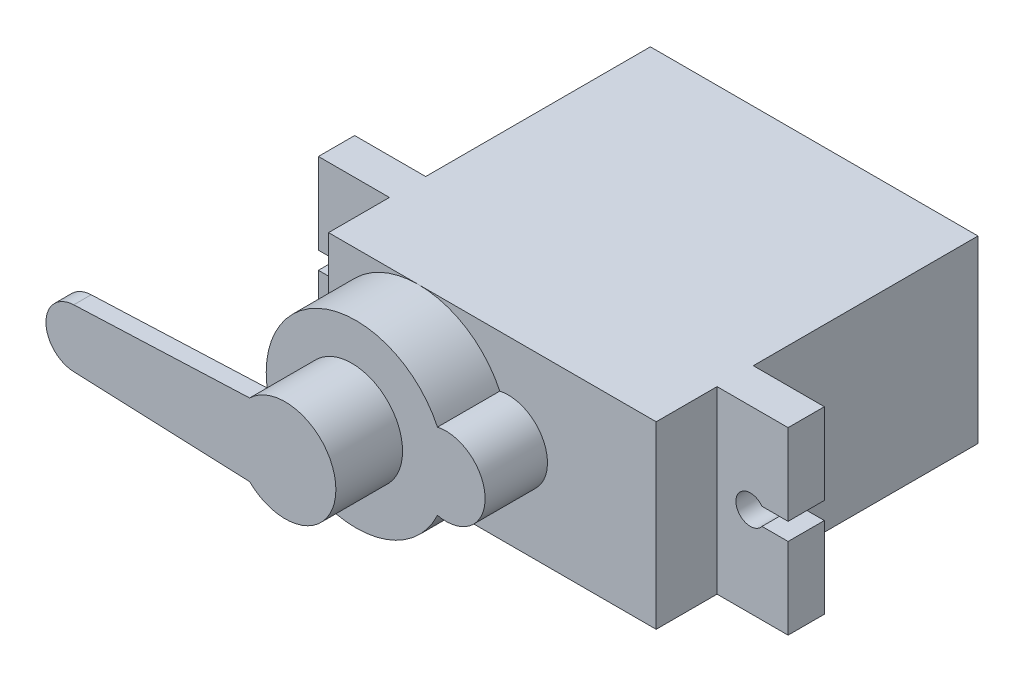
ISO-10303-21;
HEADER;
FILE_DESCRIPTION(('STEP AP214'),'2;1');
FILE_NAME('part.step','',(''),(''),'','','');
FILE_SCHEMA(('AUTOMOTIVE_DESIGN { 1 0 10303 214 1 1 1 1 }'));
ENDSEC;
DATA;
#1=APPLICATION_CONTEXT('core data for automotive mechanical design processes');
#2=APPLICATION_PROTOCOL_DEFINITION('international standard','automotive_design',2000,#1);
#3=PRODUCT_CONTEXT('',#1,'mechanical');
#4=PRODUCT('Part','Part','',(#3));
#5=PRODUCT_RELATED_PRODUCT_CATEGORY('part','',(#4));
#6=PRODUCT_DEFINITION_FORMATION('','',#4);
#7=PRODUCT_DEFINITION_CONTEXT('part definition',#1,'design');
#8=PRODUCT_DEFINITION('design','',#6,#7);
#9=PRODUCT_DEFINITION_SHAPE('','',#8);
#10=(LENGTH_UNIT() NAMED_UNIT(*) SI_UNIT(.MILLI.,.METRE.));
#11=(NAMED_UNIT(*) PLANE_ANGLE_UNIT() SI_UNIT($,.RADIAN.));
#12=(NAMED_UNIT(*) SI_UNIT($,.STERADIAN.) SOLID_ANGLE_UNIT());
#13=UNCERTAINTY_MEASURE_WITH_UNIT(LENGTH_MEASURE(1.E-05),#10,'distance_accuracy_value','');
#14=(GEOMETRIC_REPRESENTATION_CONTEXT(3) GLOBAL_UNCERTAINTY_ASSIGNED_CONTEXT((#13)) GLOBAL_UNIT_ASSIGNED_CONTEXT((#10,
#11,#12)) REPRESENTATION_CONTEXT('',''));
#15=CARTESIAN_POINT('',(0.,0.,0.));
#16=DIRECTION('',(0.,0.,1.));
#17=DIRECTION('',(1.,0.,0.));
#18=AXIS2_PLACEMENT_3D('',#15,#16,#17);
#19=CARTESIAN_POINT('',(-11.3,6.2,22.2));
#20=DIRECTION('',(1.,0.,0.));
#21=DIRECTION('',(0.,0.,-1.));
#22=AXIS2_PLACEMENT_3D('',#19,#20,#21);
#23=PLANE('',#22);
#24=DIRECTION('',(0.,1.,0.));
#25=VECTOR('',#24,1.);
#26=CARTESIAN_POINT('',(-11.3,-6.2,15.5));
#27=LINE('',#26,#25);
#28=CARTESIAN_POINT('',(-11.3,-6.2,15.5));
#29=VERTEX_POINT('',#28);
#30=CARTESIAN_POINT('',(-11.3,6.2,15.5));
#31=VERTEX_POINT('',#30);
#32=EDGE_CURVE('E378',#29,#31,#27,.T.);
#33=ORIENTED_EDGE('',*,*,#32,.T.);
#34=DIRECTION('',(0.,0.,-1.));
#35=VECTOR('',#34,1.);
#36=CARTESIAN_POINT('',(-11.3,6.2,22.2));
#37=LINE('',#36,#35);
#38=CARTESIAN_POINT('',(-11.3,6.2,0.));
#39=VERTEX_POINT('',#38);
#40=EDGE_CURVE('E530',#31,#39,#37,.T.);
#41=ORIENTED_EDGE('',*,*,#40,.T.);
#42=DIRECTION('',(0.,-1.,0.));
#43=VECTOR('',#42,1.);
#44=CARTESIAN_POINT('',(-11.3,6.2,0.));
#45=LINE('',#44,#43);
#46=CARTESIAN_POINT('',(-11.3,-6.2,0.));
#47=VERTEX_POINT('',#46);
#48=EDGE_CURVE('E506',#39,#47,#45,.T.);
#49=ORIENTED_EDGE('',*,*,#48,.T.);
#50=DIRECTION('',(0.,0.,-1.));
#51=VECTOR('',#50,1.);
#52=CARTESIAN_POINT('',(-11.3,-6.2,22.2));
#53=LINE('',#52,#51);
#54=EDGE_CURVE('E559',#29,#47,#53,.T.);
#55=ORIENTED_EDGE('',*,*,#54,.F.);
#56=EDGE_LOOP('',(#33,#41,#49,#55));
#57=FACE_BOUND('',#56,.T.);
#58=DIRECTION('',(0.,-1.,0.));
#59=VECTOR('',#58,1.);
#60=CARTESIAN_POINT('',(-11.3,1.75,4.));
#61=LINE('',#60,#59);
#62=CARTESIAN_POINT('',(-11.3,1.75,4.));
#63=VERTEX_POINT('',#62);
#64=CARTESIAN_POINT('',(-11.3,-1.75,4.));
#65=VERTEX_POINT('',#64);
#66=EDGE_CURVE('E278',#63,#65,#61,.T.);
#67=ORIENTED_EDGE('',*,*,#66,.F.);
#68=DIRECTION('',(0.,0.,-1.));
#69=VECTOR('',#68,1.);
#70=CARTESIAN_POINT('',(-11.3,1.75,4.));
#71=LINE('',#70,#69);
#72=CARTESIAN_POINT('',(-11.3,1.75,5.5));
#73=VERTEX_POINT('',#72);
#74=EDGE_CURVE('E275',#73,#63,#71,.T.);
#75=ORIENTED_EDGE('',*,*,#74,.F.);
#76=DIRECTION('',(0.,1.,0.));
#77=VECTOR('',#76,1.);
#78=CARTESIAN_POINT('',(-11.3,1.75,5.5));
#79=LINE('',#78,#77);
#80=CARTESIAN_POINT('',(-11.3,-1.75,5.5));
#81=VERTEX_POINT('',#80);
#82=EDGE_CURVE('E70',#81,#73,#79,.T.);
#83=ORIENTED_EDGE('',*,*,#82,.F.);
#84=DIRECTION('',(0.,0.,1.));
#85=VECTOR('',#84,1.);
#86=CARTESIAN_POINT('',(-11.3,-1.75,4.));
#87=LINE('',#86,#85);
#88=EDGE_CURVE('E65',#65,#81,#87,.T.);
#89=ORIENTED_EDGE('',*,*,#88,.F.);
#90=EDGE_LOOP('',(#67,#75,#83,#89));
#91=FACE_BOUND('',#90,.T.);
#92=ADVANCED_FACE('F49',(#57,#91),#23,.F.);
#93=CARTESIAN_POINT('',(13.2,-0.6,18.));
#94=DIRECTION('',(0.,1.,0.));
#95=DIRECTION('',(-1.,0.,0.));
#96=AXIS2_PLACEMENT_3D('',#93,#94,#95);
#97=PLANE('',#96);
#98=DIRECTION('',(1.,0.,0.));
#99=VECTOR('',#98,1.);
#100=CARTESIAN_POINT('',(13.2,-0.6,15.5));
#101=LINE('',#100,#99);
#102=CARTESIAN_POINT('',(14.4,-0.6,15.5));
#103=VERTEX_POINT('',#102);
#104=CARTESIAN_POINT('',(16.2,-0.6,15.5));
#105=VERTEX_POINT('',#104);
#106=EDGE_CURVE('E341',#103,#105,#101,.T.);
#107=ORIENTED_EDGE('',*,*,#106,.F.);
#108=DIRECTION('',(0.,0.,1.));
#109=VECTOR('',#108,1.);
#110=CARTESIAN_POINT('',(14.4,-0.6,12.6715728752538));
#111=LINE('',#110,#109);
#112=CARTESIAN_POINT('',(14.4,-0.6,18.));
#113=VERTEX_POINT('',#112);
#114=EDGE_CURVE('E298',#103,#113,#111,.T.);
#115=ORIENTED_EDGE('',*,*,#114,.T.);
#116=DIRECTION('',(1.,0.,0.));
#117=VECTOR('',#116,1.);
#118=CARTESIAN_POINT('',(13.2,-0.6,18.));
#119=LINE('',#118,#117);
#120=CARTESIAN_POINT('',(16.2,-0.6,18.));
#121=VERTEX_POINT('',#120);
#122=EDGE_CURVE('E316',#113,#121,#119,.T.);
#123=ORIENTED_EDGE('',*,*,#122,.T.);
#124=DIRECTION('',(0.,0.,-1.));
#125=VECTOR('',#124,1.);
#126=CARTESIAN_POINT('',(16.2,-0.6,18.));
#127=LINE('',#126,#125);
#128=EDGE_CURVE('E360',#121,#105,#127,.T.);
#129=ORIENTED_EDGE('',*,*,#128,.T.);
#130=EDGE_LOOP('',(#107,#115,#123,#129));
#131=FACE_BOUND('',#130,.T.);
#132=ADVANCED_FACE('F596',(#131),#97,.T.);
#133=CARTESIAN_POINT('',(16.2,0.6,18.));
#134=DIRECTION('',(0.,-1.,0.));
#135=DIRECTION('',(1.,0.,0.));
#136=AXIS2_PLACEMENT_3D('',#133,#134,#135);
#137=PLANE('',#136);
#138=DIRECTION('',(-1.,0.,0.));
#139=VECTOR('',#138,1.);
#140=CARTESIAN_POINT('',(16.2,0.6,18.));
#141=LINE('',#140,#139);
#142=CARTESIAN_POINT('',(16.2,0.6,18.));
#143=VERTEX_POINT('',#142);
#144=CARTESIAN_POINT('',(14.4,0.6,18.));
#145=VERTEX_POINT('',#144);
#146=EDGE_CURVE('E319',#143,#145,#141,.T.);
#147=ORIENTED_EDGE('',*,*,#146,.T.);
#148=DIRECTION('',(0.,0.,1.));
#149=VECTOR('',#148,1.);
#150=CARTESIAN_POINT('',(14.4,0.6,12.6715728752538));
#151=LINE('',#150,#149);
#152=CARTESIAN_POINT('',(14.4,0.6,15.5));
#153=VERTEX_POINT('',#152);
#154=EDGE_CURVE('E294',#145,#153,#151,.F.);
#155=ORIENTED_EDGE('',*,*,#154,.T.);
#156=DIRECTION('',(-1.,0.,0.));
#157=VECTOR('',#156,1.);
#158=CARTESIAN_POINT('',(16.2,0.6,15.5));
#159=LINE('',#158,#157);
#160=CARTESIAN_POINT('',(16.2,0.6,15.5));
#161=VERTEX_POINT('',#160);
#162=EDGE_CURVE('E344',#161,#153,#159,.T.);
#163=ORIENTED_EDGE('',*,*,#162,.F.);
#164=DIRECTION('',(0.,0.,-1.));
#165=VECTOR('',#164,1.);
#166=CARTESIAN_POINT('',(16.2,0.6,18.));
#167=LINE('',#166,#165);
#168=EDGE_CURVE('E357',#143,#161,#167,.T.);
#169=ORIENTED_EDGE('',*,*,#168,.F.);
#170=EDGE_LOOP('',(#147,#155,#163,#169));
#171=FACE_BOUND('',#170,.T.);
#172=ADVANCED_FACE('F603',(#171),#137,.T.);
#173=CARTESIAN_POINT('',(11.3,6.2,22.2));
#174=DIRECTION('',(-1.,0.,0.));
#175=DIRECTION('',(0.,0.,1.));
#176=AXIS2_PLACEMENT_3D('',#173,#174,#175);
#177=PLANE('',#176);
#178=DIRECTION('',(0.,1.,0.));
#179=VECTOR('',#178,1.);
#180=CARTESIAN_POINT('',(11.3,-6.2,15.5));
#181=LINE('',#180,#179);
#182=CARTESIAN_POINT('',(11.3,-6.2,15.5));
#183=VERTEX_POINT('',#182);
#184=CARTESIAN_POINT('',(11.3,6.2,15.5));
#185=VERTEX_POINT('',#184);
#186=EDGE_CURVE('E302',#183,#185,#181,.T.);
#187=ORIENTED_EDGE('',*,*,#186,.F.);
#188=DIRECTION('',(0.,0.,-1.));
#189=VECTOR('',#188,1.);
#190=CARTESIAN_POINT('',(11.3,-6.2,22.2));
#191=LINE('',#190,#189);
#192=CARTESIAN_POINT('',(11.3,-6.2,0.));
#193=VERTEX_POINT('',#192);
#194=EDGE_CURVE('E554',#183,#193,#191,.T.);
#195=ORIENTED_EDGE('',*,*,#194,.T.);
#196=DIRECTION('',(0.,1.,0.));
#197=VECTOR('',#196,1.);
#198=CARTESIAN_POINT('',(11.3,6.2,0.));
#199=LINE('',#198,#197);
#200=CARTESIAN_POINT('',(11.3,6.2,0.));
#201=VERTEX_POINT('',#200);
#202=EDGE_CURVE('E538',#193,#201,#199,.T.);
#203=ORIENTED_EDGE('',*,*,#202,.T.);
#204=DIRECTION('',(0.,0.,-1.));
#205=VECTOR('',#204,1.);
#206=CARTESIAN_POINT('',(11.3,6.2,22.2));
#207=LINE('',#206,#205);
#208=EDGE_CURVE('E549',#185,#201,#207,.T.);
#209=ORIENTED_EDGE('',*,*,#208,.F.);
#210=EDGE_LOOP('',(#187,#195,#203,#209));
#211=FACE_BOUND('',#210,.T.);
#212=ADVANCED_FACE('F679',(#211),#177,.F.);
#213=CARTESIAN_POINT('',(-5.1,0.,26.5));
#214=DIRECTION('',(0.,0.,-1.));
#215=DIRECTION('',(-1.,0.,0.));
#216=AXIS2_PLACEMENT_3D('',#213,#214,#215);
#217=CYLINDRICAL_SURFACE('',#216,6.2);
#218=DIRECTION('',(0.,0.,-1.));
#219=VECTOR('',#218,1.);
#220=CARTESIAN_POINT('',(0.512096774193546,-2.63521722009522,24.35));
#221=LINE('',#220,#219);
#222=CARTESIAN_POINT('',(0.512096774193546,-2.63521722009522,26.5));
#223=VERTEX_POINT('',#222);
#224=CARTESIAN_POINT('',(0.512096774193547,-2.63521722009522,22.2));
#225=VERTEX_POINT('',#224);
#226=EDGE_CURVE('E498',#223,#225,#221,.T.);
#227=ORIENTED_EDGE('',*,*,#226,.F.);
#228=CARTESIAN_POINT('',(-5.1,0.,26.5));
#229=DIRECTION('',(0.,0.,1.));
#230=DIRECTION('',(1.,0.,0.));
#231=AXIS2_PLACEMENT_3D('',#228,#229,#230);
#232=CIRCLE('',#231,6.2);
#233=CARTESIAN_POINT('',(0.512096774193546,2.63521722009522,26.5));
#234=VERTEX_POINT('',#233);
#235=EDGE_CURVE('E502',#234,#223,#232,.T.);
#236=ORIENTED_EDGE('',*,*,#235,.F.);
#237=DIRECTION('',(0.,0.,-1.));
#238=VECTOR('',#237,1.);
#239=CARTESIAN_POINT('',(0.512096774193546,2.63521722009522,24.35));
#240=LINE('',#239,#238);
#241=CARTESIAN_POINT('',(0.512096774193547,2.63521722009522,22.2));
#242=VERTEX_POINT('',#241);
#243=EDGE_CURVE('E494',#242,#234,#240,.F.);
#244=ORIENTED_EDGE('',*,*,#243,.F.);
#245=CARTESIAN_POINT('',(-5.1,0.,22.2));
#246=DIRECTION('',(0.,0.,1.));
#247=DIRECTION('',(1.,0.,0.));
#248=AXIS2_PLACEMENT_3D('',#245,#246,#247);
#249=CIRCLE('',#248,6.2);
#250=CARTESIAN_POINT('',(-5.1,6.2,22.2));
#251=VERTEX_POINT('',#250);
#252=EDGE_CURVE('E510',#242,#251,#249,.T.);
#253=ORIENTED_EDGE('',*,*,#252,.T.);
#254=CARTESIAN_POINT('',(-11.3,0.,22.2));
#255=VERTEX_POINT('',#254);
#256=EDGE_CURVE('E501',#251,#255,#249,.T.);
#257=ORIENTED_EDGE('',*,*,#256,.T.);
#258=CARTESIAN_POINT('',(-5.1,-6.2,22.2));
#259=VERTEX_POINT('',#258);
#260=EDGE_CURVE('E488',#255,#259,#249,.T.);
#261=ORIENTED_EDGE('',*,*,#260,.T.);
#262=EDGE_CURVE('E511',#259,#225,#249,.T.);
#263=ORIENTED_EDGE('',*,*,#262,.T.);
#264=EDGE_LOOP('',(#227,#236,#244,#253,#257,#261,#263));
#265=FACE_BOUND('',#264,.T.);
#266=ADVANCED_FACE('F647',(#265),#217,.T.);
#267=CARTESIAN_POINT('',(0.,0.,22.2));
#268=DIRECTION('',(0.,0.,1.));
#269=DIRECTION('',(1.,0.,0.));
#270=AXIS2_PLACEMENT_3D('',#267,#268,#269);
#271=PLANE('',#270);
#272=ORIENTED_EDGE('',*,*,#256,.F.);
#273=DIRECTION('',(-1.,0.,0.));
#274=VECTOR('',#273,1.);
#275=CARTESIAN_POINT('',(-11.3,6.2,22.2));
#276=LINE('',#275,#274);
#277=CARTESIAN_POINT('',(-11.3,6.2,22.2));
#278=VERTEX_POINT('',#277);
#279=EDGE_CURVE('E525',#251,#278,#276,.T.);
#280=ORIENTED_EDGE('',*,*,#279,.T.);
#281=DIRECTION('',(0.,-1.,0.));
#282=VECTOR('',#281,1.);
#283=CARTESIAN_POINT('',(-11.3,6.2,22.2));
#284=LINE('',#283,#282);
#285=EDGE_CURVE('E512',#278,#255,#284,.T.);
#286=ORIENTED_EDGE('',*,*,#285,.T.);
#287=EDGE_LOOP('',(#272,#280,#286));
#288=FACE_BOUND('',#287,.T.);
#289=ADVANCED_FACE('F618',(#288),#271,.T.);
#290=ORIENTED_EDGE('',*,*,#260,.F.);
#291=CARTESIAN_POINT('',(-11.3,-6.2,22.2));
#292=VERTEX_POINT('',#291);
#293=EDGE_CURVE('E517',#255,#292,#284,.T.);
#294=ORIENTED_EDGE('',*,*,#293,.T.);
#295=DIRECTION('',(1.,0.,0.));
#296=VECTOR('',#295,1.);
#297=CARTESIAN_POINT('',(-11.3,-6.2,22.2));
#298=LINE('',#297,#296);
#299=EDGE_CURVE('E518',#292,#259,#298,.T.);
#300=ORIENTED_EDGE('',*,*,#299,.T.);
#301=EDGE_LOOP('',(#290,#294,#300));
#302=FACE_BOUND('',#301,.T.);
#303=ADVANCED_FACE('F608',(#302),#271,.T.);
#304=CARTESIAN_POINT('',(-11.3,6.2,18.));
#305=VERTEX_POINT('',#304);
#306=EDGE_CURVE('E546',#278,#305,#37,.T.);
#307=ORIENTED_EDGE('',*,*,#306,.T.);
#308=DIRECTION('',(0.,1.,0.));
#309=VECTOR('',#308,1.);
#310=CARTESIAN_POINT('',(-11.3,-6.2,18.));
#311=LINE('',#310,#309);
#312=CARTESIAN_POINT('',(-11.3,-6.2,18.));
#313=VERTEX_POINT('',#312);
#314=EDGE_CURVE('E379',#313,#305,#311,.T.);
#315=ORIENTED_EDGE('',*,*,#314,.F.);
#316=EDGE_CURVE('E560',#292,#313,#53,.T.);
#317=ORIENTED_EDGE('',*,*,#316,.F.);
#318=ORIENTED_EDGE('',*,*,#293,.F.);
#319=ORIENTED_EDGE('',*,*,#285,.F.);
#320=EDGE_LOOP('',(#307,#315,#317,#318,#319));
#321=FACE_BOUND('',#320,.T.);
#322=ADVANCED_FACE('F51',(#321),#23,.F.);
#323=CARTESIAN_POINT('',(-11.3,-6.2,22.2));
#324=DIRECTION('',(0.,1.,0.));
#325=DIRECTION('',(-1.,0.,0.));
#326=AXIS2_PLACEMENT_3D('',#323,#324,#325);
#327=PLANE('',#326);
#328=DIRECTION('',(1.,0.,0.));
#329=VECTOR('',#328,1.);
#330=CARTESIAN_POINT('',(-11.3,-6.2,0.));
#331=LINE('',#330,#329);
#332=EDGE_CURVE('E534',#47,#193,#331,.T.);
#333=ORIENTED_EDGE('',*,*,#332,.T.);
#334=ORIENTED_EDGE('',*,*,#194,.F.);
#335=DIRECTION('',(-1.,0.,0.));
#336=VECTOR('',#335,1.);
#337=CARTESIAN_POINT('',(16.2,-6.2,15.5));
#338=LINE('',#337,#336);
#339=CARTESIAN_POINT('',(16.2,-6.2,15.5));
#340=VERTEX_POINT('',#339);
#341=EDGE_CURVE('E334',#340,#183,#338,.T.);
#342=ORIENTED_EDGE('',*,*,#341,.F.);
#343=DIRECTION('',(0.,0.,-1.));
#344=VECTOR('',#343,1.);
#345=CARTESIAN_POINT('',(16.2,-6.2,18.));
#346=LINE('',#345,#344);
#347=CARTESIAN_POINT('',(16.2,-6.2,18.));
#348=VERTEX_POINT('',#347);
#349=EDGE_CURVE('E364',#348,#340,#346,.T.);
#350=ORIENTED_EDGE('',*,*,#349,.F.);
#351=DIRECTION('',(-1.,0.,0.));
#352=VECTOR('',#351,1.);
#353=CARTESIAN_POINT('',(16.2,-6.2,18.));
#354=LINE('',#353,#352);
#355=CARTESIAN_POINT('',(11.3,-6.2,18.));
#356=VERTEX_POINT('',#355);
#357=EDGE_CURVE('E307',#348,#356,#354,.T.);
#358=ORIENTED_EDGE('',*,*,#357,.T.);
#359=CARTESIAN_POINT('',(11.3,-6.2,22.2));
#360=VERTEX_POINT('',#359);
#361=EDGE_CURVE('E555',#360,#356,#191,.T.);
#362=ORIENTED_EDGE('',*,*,#361,.F.);
#363=EDGE_CURVE('E516',#259,#360,#298,.T.);
#364=ORIENTED_EDGE('',*,*,#363,.F.);
#365=ORIENTED_EDGE('',*,*,#299,.F.);
#366=ORIENTED_EDGE('',*,*,#316,.T.);
#367=DIRECTION('',(1.,0.,0.));
#368=VECTOR('',#367,1.);
#369=CARTESIAN_POINT('',(-16.2,-6.2,18.));
#370=LINE('',#369,#368);
#371=CARTESIAN_POINT('',(-16.2,-6.2,18.));
#372=VERTEX_POINT('',#371);
#373=EDGE_CURVE('E400',#372,#313,#370,.T.);
#374=ORIENTED_EDGE('',*,*,#373,.F.);
#375=DIRECTION('',(0.,0.,-1.));
#376=VECTOR('',#375,1.);
#377=CARTESIAN_POINT('',(-16.2,-6.2,18.));
#378=LINE('',#377,#376);
#379=CARTESIAN_POINT('',(-16.2,-6.2,15.5));
#380=VERTEX_POINT('',#379);
#381=EDGE_CURVE('E404',#372,#380,#378,.T.);
#382=ORIENTED_EDGE('',*,*,#381,.T.);
#383=DIRECTION('',(1.,0.,0.));
#384=VECTOR('',#383,1.);
#385=CARTESIAN_POINT('',(-16.2,-6.2,15.5));
#386=LINE('',#385,#384);
#387=EDGE_CURVE('E384',#380,#29,#386,.T.);
#388=ORIENTED_EDGE('',*,*,#387,.T.);
#389=ORIENTED_EDGE('',*,*,#54,.T.);
#390=EDGE_LOOP('',(#333,#334,#342,#350,#358,#362,#364,#365,#366,#374,#382,#388,#389));
#391=FACE_BOUND('',#390,.T.);
#392=ADVANCED_FACE('F607',(#391),#327,.F.);
#393=ORIENTED_EDGE('',*,*,#361,.T.);
#394=DIRECTION('',(0.,1.,0.));
#395=VECTOR('',#394,1.);
#396=CARTESIAN_POINT('',(11.3,-6.2,18.));
#397=LINE('',#396,#395);
#398=CARTESIAN_POINT('',(11.3,6.2,18.));
#399=VERTEX_POINT('',#398);
#400=EDGE_CURVE('E303',#356,#399,#397,.T.);
#401=ORIENTED_EDGE('',*,*,#400,.T.);
#402=CARTESIAN_POINT('',(11.3,6.2,22.2));
#403=VERTEX_POINT('',#402);
#404=EDGE_CURVE('E550',#403,#399,#207,.T.);
#405=ORIENTED_EDGE('',*,*,#404,.F.);
#406=DIRECTION('',(0.,1.,0.));
#407=VECTOR('',#406,1.);
#408=CARTESIAN_POINT('',(11.3,6.2,22.2));
#409=LINE('',#408,#407);
#410=EDGE_CURVE('E522',#360,#403,#409,.T.);
#411=ORIENTED_EDGE('',*,*,#410,.F.);
#412=EDGE_LOOP('',(#393,#401,#405,#411));
#413=FACE_BOUND('',#412,.T.);
#414=ADVANCED_FACE('F615',(#413),#177,.F.);
#415=CARTESIAN_POINT('',(-11.3,6.2,22.2));
#416=DIRECTION('',(0.,-1.,0.));
#417=DIRECTION('',(1.,0.,0.));
#418=AXIS2_PLACEMENT_3D('',#415,#416,#417);
#419=PLANE('',#418);
#420=DIRECTION('',(-1.,0.,0.));
#421=VECTOR('',#420,1.);
#422=CARTESIAN_POINT('',(-11.3,6.2,0.));
#423=LINE('',#422,#421);
#424=EDGE_CURVE('E542',#201,#39,#423,.T.);
#425=ORIENTED_EDGE('',*,*,#424,.T.);
#426=ORIENTED_EDGE('',*,*,#40,.F.);
#427=DIRECTION('',(-1.,0.,0.));
#428=VECTOR('',#427,1.);
#429=CARTESIAN_POINT('',(-11.3,6.2,15.5));
#430=LINE('',#429,#428);
#431=CARTESIAN_POINT('',(-16.2,6.2,15.5));
#432=VERTEX_POINT('',#431);
#433=EDGE_CURVE('E408',#31,#432,#430,.T.);
#434=ORIENTED_EDGE('',*,*,#433,.T.);
#435=DIRECTION('',(0.,0.,-1.));
#436=VECTOR('',#435,1.);
#437=CARTESIAN_POINT('',(-16.2,6.2,18.));
#438=LINE('',#437,#436);
#439=CARTESIAN_POINT('',(-16.2,6.2,18.));
#440=VERTEX_POINT('',#439);
#441=EDGE_CURVE('E438',#440,#432,#438,.T.);
#442=ORIENTED_EDGE('',*,*,#441,.F.);
#443=DIRECTION('',(-1.,0.,0.));
#444=VECTOR('',#443,1.);
#445=CARTESIAN_POINT('',(-11.3,6.2,18.));
#446=LINE('',#445,#444);
#447=EDGE_CURVE('E383',#305,#440,#446,.T.);
#448=ORIENTED_EDGE('',*,*,#447,.F.);
#449=ORIENTED_EDGE('',*,*,#306,.F.);
#450=ORIENTED_EDGE('',*,*,#279,.F.);
#451=EDGE_CURVE('E526',#403,#251,#276,.T.);
#452=ORIENTED_EDGE('',*,*,#451,.F.);
#453=ORIENTED_EDGE('',*,*,#404,.T.);
#454=DIRECTION('',(1.,0.,0.));
#455=VECTOR('',#454,1.);
#456=CARTESIAN_POINT('',(11.3,6.2,18.));
#457=LINE('',#456,#455);
#458=CARTESIAN_POINT('',(16.2,6.2,18.));
#459=VERTEX_POINT('',#458);
#460=EDGE_CURVE('E327',#399,#459,#457,.T.);
#461=ORIENTED_EDGE('',*,*,#460,.T.);
#462=DIRECTION('',(0.,0.,-1.));
#463=VECTOR('',#462,1.);
#464=CARTESIAN_POINT('',(16.2,6.2,18.));
#465=LINE('',#464,#463);
#466=CARTESIAN_POINT('',(16.2,6.2,15.5));
#467=VERTEX_POINT('',#466);
#468=EDGE_CURVE('E331',#459,#467,#465,.T.);
#469=ORIENTED_EDGE('',*,*,#468,.T.);
#470=DIRECTION('',(1.,0.,0.));
#471=VECTOR('',#470,1.);
#472=CARTESIAN_POINT('',(11.3,6.2,15.5));
#473=LINE('',#472,#471);
#474=EDGE_CURVE('E308',#185,#467,#473,.T.);
#475=ORIENTED_EDGE('',*,*,#474,.F.);
#476=ORIENTED_EDGE('',*,*,#208,.T.);
#477=EDGE_LOOP('',(#425,#426,#434,#442,#448,#449,#450,#452,#453,#461,#469,#475,#476));
#478=FACE_BOUND('',#477,.T.);
#479=ADVANCED_FACE('F630',(#478),#419,.F.);
#480=ORIENTED_EDGE('',*,*,#252,.F.);
#481=CARTESIAN_POINT('',(1.1,0.,22.2));
#482=DIRECTION('',(0.,0.,1.));
#483=DIRECTION('',(1.,0.,0.));
#484=AXIS2_PLACEMENT_3D('',#481,#482,#483);
#485=CIRCLE('',#484,2.7);
#486=EDGE_CURVE('E483',#225,#242,#485,.T.);
#487=ORIENTED_EDGE('',*,*,#486,.F.);
#488=ORIENTED_EDGE('',*,*,#262,.F.);
#489=ORIENTED_EDGE('',*,*,#363,.T.);
#490=ORIENTED_EDGE('',*,*,#410,.T.);
#491=ORIENTED_EDGE('',*,*,#451,.T.);
#492=EDGE_LOOP('',(#480,#487,#488,#489,#490,#491));
#493=FACE_BOUND('',#492,.T.);
#494=ADVANCED_FACE('F621',(#493),#271,.T.);
#495=CARTESIAN_POINT('',(0.,0.,0.));
#496=DIRECTION('',(0.,0.,1.));
#497=DIRECTION('',(1.,0.,0.));
#498=AXIS2_PLACEMENT_3D('',#495,#496,#497);
#499=PLANE('',#498);
#500=ORIENTED_EDGE('',*,*,#48,.F.);
#501=ORIENTED_EDGE('',*,*,#424,.F.);
#502=ORIENTED_EDGE('',*,*,#202,.F.);
#503=ORIENTED_EDGE('',*,*,#332,.F.);
#504=EDGE_LOOP('',(#500,#501,#502,#503));
#505=FACE_BOUND('',#504,.T.);
#506=ADVANCED_FACE('F690',(#505),#499,.F.);
#507=CARTESIAN_POINT('',(-5.1,0.,26.5));
#508=DIRECTION('',(0.,0.,1.));
#509=DIRECTION('',(1.,0.,0.));
#510=AXIS2_PLACEMENT_3D('',#507,#508,#509);
#511=PLANE('',#510);
#512=CARTESIAN_POINT('',(-5.39467892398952,0.,26.5));
#513=DIRECTION('',(0.,0.,1.));
#514=DIRECTION('',(1.,0.,0.));
#515=AXIS2_PLACEMENT_3D('',#512,#513,#514);
#516=CIRCLE('',#515,3.5);
#517=CARTESIAN_POINT('',(-1.89467892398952,0.,26.5));
#518=VERTEX_POINT('',#517);
#519=EDGE_CURVE('E484',#518,#518,#516,.T.);
#520=ORIENTED_EDGE('',*,*,#519,.F.);
#521=EDGE_LOOP('',(#520));
#522=FACE_BOUND('',#521,.T.);
#523=ORIENTED_EDGE('',*,*,#235,.T.);
#524=CARTESIAN_POINT('',(1.1,0.,26.5));
#525=DIRECTION('',(0.,0.,1.));
#526=DIRECTION('',(1.,0.,0.));
#527=AXIS2_PLACEMENT_3D('',#524,#525,#526);
#528=CIRCLE('',#527,2.7);
#529=EDGE_CURVE('E491',#223,#234,#528,.T.);
#530=ORIENTED_EDGE('',*,*,#529,.T.);
#531=EDGE_LOOP('',(#523,#530));
#532=FACE_BOUND('',#531,.T.);
#533=ADVANCED_FACE('F697',(#522,#532),#511,.T.);
#534=CARTESIAN_POINT('',(1.1,0.,34.1367532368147));
#535=DIRECTION('',(0.,0.,-1.));
#536=DIRECTION('',(-1.,0.,0.));
#537=AXIS2_PLACEMENT_3D('',#534,#535,#536);
#538=CYLINDRICAL_SURFACE('',#537,2.7);
#539=ORIENTED_EDGE('',*,*,#529,.F.);
#540=ORIENTED_EDGE('',*,*,#226,.T.);
#541=ORIENTED_EDGE('',*,*,#486,.T.);
#542=ORIENTED_EDGE('',*,*,#243,.T.);
#543=EDGE_LOOP('',(#539,#540,#541,#542));
#544=FACE_BOUND('',#543,.T.);
#545=ADVANCED_FACE('F698',(#544),#538,.T.);
#546=CARTESIAN_POINT('',(-5.39467892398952,0.,31.1));
#547=DIRECTION('',(0.,0.,-1.));
#548=DIRECTION('',(-1.,0.,0.));
#549=AXIS2_PLACEMENT_3D('',#546,#547,#548);
#550=CYLINDRICAL_SURFACE('',#549,3.5);
#551=CARTESIAN_POINT('',(-5.39467892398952,0.,31.1));
#552=DIRECTION('',(0.,0.,1.));
#553=DIRECTION('',(1.,0.,0.));
#554=AXIS2_PLACEMENT_3D('',#551,#552,#553);
#555=CIRCLE('',#554,3.5);
#556=CARTESIAN_POINT('',(-7.84416866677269,-2.5,31.1));
#557=VERTEX_POINT('',#556);
#558=CARTESIAN_POINT('',(-7.8441686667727,2.5,31.1));
#559=VERTEX_POINT('',#558);
#560=EDGE_CURVE('E470',#557,#559,#555,.T.);
#561=ORIENTED_EDGE('',*,*,#560,.F.);
#562=DIRECTION('',(0.,0.,1.));
#563=VECTOR('',#562,1.);
#564=CARTESIAN_POINT('',(-7.8441686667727,-2.5,29.9));
#565=LINE('',#564,#563);
#566=CARTESIAN_POINT('',(-7.8441686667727,-2.5,29.9));
#567=VERTEX_POINT('',#566);
#568=EDGE_CURVE('E466',#567,#557,#565,.T.);
#569=ORIENTED_EDGE('',*,*,#568,.F.);
#570=CARTESIAN_POINT('',(-5.39467892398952,0.,29.9));
#571=DIRECTION('',(0.,0.,1.));
#572=DIRECTION('',(1.,0.,0.));
#573=AXIS2_PLACEMENT_3D('',#570,#571,#572);
#574=CIRCLE('',#573,3.5);
#575=CARTESIAN_POINT('',(-7.8441686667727,2.5,29.9));
#576=VERTEX_POINT('',#575);
#577=EDGE_CURVE('E58',#576,#567,#574,.T.);
#578=ORIENTED_EDGE('',*,*,#577,.F.);
#579=DIRECTION('',(0.,0.,1.));
#580=VECTOR('',#579,1.);
#581=CARTESIAN_POINT('',(-7.8441686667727,2.5,29.9));
#582=LINE('',#581,#580);
#583=EDGE_CURVE('E456',#576,#559,#582,.T.);
#584=ORIENTED_EDGE('',*,*,#583,.T.);
#585=EDGE_LOOP('',(#561,#569,#578,#584));
#586=FACE_BOUND('',#585,.T.);
#587=ORIENTED_EDGE('',*,*,#519,.T.);
#588=EDGE_LOOP('',(#587));
#589=FACE_BOUND('',#588,.T.);
#590=ADVANCED_FACE('F576',(#586,#589),#550,.T.);
#591=CARTESIAN_POINT('',(-5.39467892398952,0.,31.1));
#592=DIRECTION('',(0.,0.,1.));
#593=DIRECTION('',(1.,0.,0.));
#594=AXIS2_PLACEMENT_3D('',#591,#592,#593);
#595=PLANE('',#594);
#596=ORIENTED_EDGE('',*,*,#560,.T.);
#597=DIRECTION('',(-0.999151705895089,-0.0411809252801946,0.));
#598=VECTOR('',#597,1.);
#599=CARTESIAN_POINT('',(-7.8441686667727,2.5,31.1));
#600=LINE('',#599,#598);
#601=CARTESIAN_POINT('',(-19.9754126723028,2.,31.1));
#602=VERTEX_POINT('',#601);
#603=EDGE_CURVE('E442',#559,#602,#600,.T.);
#604=ORIENTED_EDGE('',*,*,#603,.T.);
#605=CARTESIAN_POINT('',(-19.892980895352,0.,31.1));
#606=DIRECTION('',(0.,0.,1.));
#607=DIRECTION('',(1.,0.,0.));
#608=AXIS2_PLACEMENT_3D('',#605,#606,#607);
#609=CIRCLE('',#608,2.00169802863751);
#610=CARTESIAN_POINT('',(-19.9754126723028,-2.,31.1));
#611=VERTEX_POINT('',#610);
#612=EDGE_CURVE('E460',#602,#611,#609,.T.);
#613=ORIENTED_EDGE('',*,*,#612,.T.);
#614=DIRECTION('',(0.999151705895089,-0.0411809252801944,0.));
#615=VECTOR('',#614,1.);
#616=CARTESIAN_POINT('',(-19.9754126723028,-2.,31.1));
#617=LINE('',#616,#615);
#618=EDGE_CURVE('E448',#611,#557,#617,.T.);
#619=ORIENTED_EDGE('',*,*,#618,.T.);
#620=EDGE_LOOP('',(#596,#604,#613,#619));
#621=FACE_BOUND('',#620,.T.);
#622=ADVANCED_FACE('F579',(#621),#595,.T.);
#623=CARTESIAN_POINT('',(-19.9754126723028,-2.,29.9));
#624=DIRECTION('',(-0.0411809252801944,-0.999151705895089,0.));
#625=DIRECTION('',(0.999151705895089,-0.0411809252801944,0.));
#626=AXIS2_PLACEMENT_3D('',#623,#624,#625);
#627=PLANE('',#626);
#628=ORIENTED_EDGE('',*,*,#618,.F.);
#629=DIRECTION('',(0.,0.,1.));
#630=VECTOR('',#629,1.);
#631=CARTESIAN_POINT('',(-19.9754126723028,-2.,29.9));
#632=LINE('',#631,#630);
#633=CARTESIAN_POINT('',(-19.9754126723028,-2.,29.9));
#634=VERTEX_POINT('',#633);
#635=EDGE_CURVE('E471',#634,#611,#632,.T.);
#636=ORIENTED_EDGE('',*,*,#635,.F.);
#637=DIRECTION('',(0.999151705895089,-0.0411809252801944,0.));
#638=VECTOR('',#637,1.);
#639=CARTESIAN_POINT('',(-19.9754126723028,-2.,29.9));
#640=LINE('',#639,#638);
#641=EDGE_CURVE('E452',#634,#567,#640,.T.);
#642=ORIENTED_EDGE('',*,*,#641,.T.);
#643=ORIENTED_EDGE('',*,*,#568,.T.);
#644=EDGE_LOOP('',(#628,#636,#642,#643));
#645=FACE_BOUND('',#644,.T.);
#646=ADVANCED_FACE('F574',(#645),#627,.T.);
#647=CARTESIAN_POINT('',(-19.892980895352,0.,29.9));
#648=DIRECTION('',(0.,0.,1.));
#649=DIRECTION('',(1.,0.,0.));
#650=AXIS2_PLACEMENT_3D('',#647,#648,#649);
#651=CYLINDRICAL_SURFACE('',#650,2.00169802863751);
#652=ORIENTED_EDGE('',*,*,#612,.F.);
#653=DIRECTION('',(0.,0.,1.));
#654=VECTOR('',#653,1.);
#655=CARTESIAN_POINT('',(-19.9754126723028,2.,29.9));
#656=LINE('',#655,#654);
#657=CARTESIAN_POINT('',(-19.9754126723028,2.,29.9));
#658=VERTEX_POINT('',#657);
#659=EDGE_CURVE('E474',#658,#602,#656,.T.);
#660=ORIENTED_EDGE('',*,*,#659,.F.);
#661=CARTESIAN_POINT('',(-19.892980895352,0.,29.9));
#662=DIRECTION('',(0.,0.,1.));
#663=DIRECTION('',(1.,0.,0.));
#664=AXIS2_PLACEMENT_3D('',#661,#662,#663);
#665=CIRCLE('',#664,2.00169802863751);
#666=EDGE_CURVE('E447',#658,#634,#665,.T.);
#667=ORIENTED_EDGE('',*,*,#666,.T.);
#668=ORIENTED_EDGE('',*,*,#635,.T.);
#669=EDGE_LOOP('',(#652,#660,#667,#668));
#670=FACE_BOUND('',#669,.T.);
#671=ADVANCED_FACE('F582',(#670),#651,.T.);
#672=CARTESIAN_POINT('',(-7.8441686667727,2.5,29.9));
#673=DIRECTION('',(-0.0411809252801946,0.999151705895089,0.));
#674=DIRECTION('',(-0.99915170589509,-0.0411809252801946,0.));
#675=AXIS2_PLACEMENT_3D('',#672,#673,#674);
#676=PLANE('',#675);
#677=ORIENTED_EDGE('',*,*,#603,.F.);
#678=ORIENTED_EDGE('',*,*,#583,.F.);
#679=DIRECTION('',(-0.999151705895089,-0.0411809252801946,0.));
#680=VECTOR('',#679,1.);
#681=CARTESIAN_POINT('',(-7.8441686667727,2.5,29.9));
#682=LINE('',#681,#680);
#683=EDGE_CURVE('E443',#576,#658,#682,.T.);
#684=ORIENTED_EDGE('',*,*,#683,.T.);
#685=ORIENTED_EDGE('',*,*,#659,.T.);
#686=EDGE_LOOP('',(#677,#678,#684,#685));
#687=FACE_BOUND('',#686,.T.);
#688=ADVANCED_FACE('F584',(#687),#676,.T.);
#689=CARTESIAN_POINT('',(-19.892980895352,0.,29.9));
#690=DIRECTION('',(0.,0.,1.));
#691=DIRECTION('',(1.,0.,0.));
#692=AXIS2_PLACEMENT_3D('',#689,#690,#691);
#693=PLANE('',#692);
#694=ORIENTED_EDGE('',*,*,#683,.F.);
#695=ORIENTED_EDGE('',*,*,#577,.T.);
#696=ORIENTED_EDGE('',*,*,#641,.F.);
#697=ORIENTED_EDGE('',*,*,#666,.F.);
#698=EDGE_LOOP('',(#694,#695,#696,#697));
#699=FACE_BOUND('',#698,.T.);
#700=ADVANCED_FACE('F568',(#699),#693,.F.);
#701=CARTESIAN_POINT('',(-16.2,6.2,18.));
#702=DIRECTION('',(1.,0.,0.));
#703=DIRECTION('',(0.,1.,0.));
#704=AXIS2_PLACEMENT_3D('',#701,#702,#703);
#705=PLANE('',#704);
#706=DIRECTION('',(0.,-1.,0.));
#707=VECTOR('',#706,1.);
#708=CARTESIAN_POINT('',(-16.2,6.2,15.5));
#709=LINE('',#708,#707);
#710=CARTESIAN_POINT('',(-16.2,0.6,15.5));
#711=VERTEX_POINT('',#710);
#712=EDGE_CURVE('E411',#432,#711,#709,.T.);
#713=ORIENTED_EDGE('',*,*,#712,.T.);
#714=DIRECTION('',(0.,0.,-1.));
#715=VECTOR('',#714,1.);
#716=CARTESIAN_POINT('',(-16.2,0.6,18.));
#717=LINE('',#716,#715);
#718=CARTESIAN_POINT('',(-16.2,0.6,18.));
#719=VERTEX_POINT('',#718);
#720=EDGE_CURVE('E434',#719,#711,#717,.T.);
#721=ORIENTED_EDGE('',*,*,#720,.F.);
#722=DIRECTION('',(0.,-1.,0.));
#723=VECTOR('',#722,1.);
#724=CARTESIAN_POINT('',(-16.2,6.2,18.));
#725=LINE('',#724,#723);
#726=EDGE_CURVE('E387',#440,#719,#725,.T.);
#727=ORIENTED_EDGE('',*,*,#726,.F.);
#728=ORIENTED_EDGE('',*,*,#441,.T.);
#729=EDGE_LOOP('',(#713,#721,#727,#728));
#730=FACE_BOUND('',#729,.T.);
#731=ADVANCED_FACE('F591',(#730),#705,.F.);
#732=CARTESIAN_POINT('',(-16.2,0.6,18.));
#733=DIRECTION('',(0.,1.,0.));
#734=DIRECTION('',(-1.,0.,0.));
#735=AXIS2_PLACEMENT_3D('',#732,#733,#734);
#736=PLANE('',#735);
#737=DIRECTION('',(1.,0.,0.));
#738=VECTOR('',#737,1.);
#739=CARTESIAN_POINT('',(-16.2,0.6,15.5));
#740=LINE('',#739,#738);
#741=CARTESIAN_POINT('',(-14.4,0.6,15.5));
#742=VERTEX_POINT('',#741);
#743=EDGE_CURVE('E414',#711,#742,#740,.T.);
#744=ORIENTED_EDGE('',*,*,#743,.T.);
#745=DIRECTION('',(0.,0.,1.));
#746=VECTOR('',#745,1.);
#747=CARTESIAN_POINT('',(-14.4,0.6,12.6715728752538));
#748=LINE('',#747,#746);
#749=CARTESIAN_POINT('',(-14.4,0.6,18.));
#750=VERTEX_POINT('',#749);
#751=EDGE_CURVE('E374',#742,#750,#748,.T.);
#752=ORIENTED_EDGE('',*,*,#751,.T.);
#753=DIRECTION('',(1.,0.,0.));
#754=VECTOR('',#753,1.);
#755=CARTESIAN_POINT('',(-16.2,0.6,18.));
#756=LINE('',#755,#754);
#757=EDGE_CURVE('E390',#719,#750,#756,.T.);
#758=ORIENTED_EDGE('',*,*,#757,.F.);
#759=ORIENTED_EDGE('',*,*,#720,.T.);
#760=EDGE_LOOP('',(#744,#752,#758,#759));
#761=FACE_BOUND('',#760,.T.);
#762=ADVANCED_FACE('F751',(#761),#736,.F.);
#763=CARTESIAN_POINT('',(-13.2,-0.6,18.));
#764=DIRECTION('',(0.,-1.,0.));
#765=DIRECTION('',(1.,0.,0.));
#766=AXIS2_PLACEMENT_3D('',#763,#764,#765);
#767=PLANE('',#766);
#768=DIRECTION('',(-1.,0.,0.));
#769=VECTOR('',#768,1.);
#770=CARTESIAN_POINT('',(-13.2,-0.6,18.));
#771=LINE('',#770,#769);
#772=CARTESIAN_POINT('',(-14.4,-0.6,18.));
#773=VERTEX_POINT('',#772);
#774=CARTESIAN_POINT('',(-16.2,-0.6,18.));
#775=VERTEX_POINT('',#774);
#776=EDGE_CURVE('E394',#773,#775,#771,.T.);
#777=ORIENTED_EDGE('',*,*,#776,.F.);
#778=DIRECTION('',(0.,0.,1.));
#779=VECTOR('',#778,1.);
#780=CARTESIAN_POINT('',(-14.4,-0.6,12.6715728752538));
#781=LINE('',#780,#779);
#782=CARTESIAN_POINT('',(-14.4,-0.6,15.5));
#783=VERTEX_POINT('',#782);
#784=EDGE_CURVE('E370',#773,#783,#781,.F.);
#785=ORIENTED_EDGE('',*,*,#784,.T.);
#786=DIRECTION('',(-1.,0.,0.));
#787=VECTOR('',#786,1.);
#788=CARTESIAN_POINT('',(-13.2,-0.6,15.5));
#789=LINE('',#788,#787);
#790=CARTESIAN_POINT('',(-16.2,-0.6,15.5));
#791=VERTEX_POINT('',#790);
#792=EDGE_CURVE('E418',#783,#791,#789,.T.);
#793=ORIENTED_EDGE('',*,*,#792,.T.);
#794=DIRECTION('',(0.,0.,-1.));
#795=VECTOR('',#794,1.);
#796=CARTESIAN_POINT('',(-16.2,-0.6,18.));
#797=LINE('',#796,#795);
#798=EDGE_CURVE('E430',#775,#791,#797,.T.);
#799=ORIENTED_EDGE('',*,*,#798,.F.);
#800=EDGE_LOOP('',(#777,#785,#793,#799));
#801=FACE_BOUND('',#800,.T.);
#802=ADVANCED_FACE('F747',(#801),#767,.F.);
#803=CARTESIAN_POINT('',(-16.2,-0.6,18.));
#804=DIRECTION('',(1.,0.,0.));
#805=DIRECTION('',(0.,1.,0.));
#806=AXIS2_PLACEMENT_3D('',#803,#804,#805);
#807=PLANE('',#806);
#808=DIRECTION('',(0.,-1.,0.));
#809=VECTOR('',#808,1.);
#810=CARTESIAN_POINT('',(-16.2,-0.6,15.5));
#811=LINE('',#810,#809);
#812=EDGE_CURVE('E421',#791,#380,#811,.T.);
#813=ORIENTED_EDGE('',*,*,#812,.T.);
#814=ORIENTED_EDGE('',*,*,#381,.F.);
#815=DIRECTION('',(0.,-1.,0.));
#816=VECTOR('',#815,1.);
#817=CARTESIAN_POINT('',(-16.2,-0.6,18.));
#818=LINE('',#817,#816);
#819=EDGE_CURVE('E397',#775,#372,#818,.T.);
#820=ORIENTED_EDGE('',*,*,#819,.F.);
#821=ORIENTED_EDGE('',*,*,#798,.T.);
#822=EDGE_LOOP('',(#813,#814,#820,#821));
#823=FACE_BOUND('',#822,.T.);
#824=ADVANCED_FACE('F741',(#823),#807,.F.);
#825=CARTESIAN_POINT('',(0.,0.,18.));
#826=DIRECTION('',(0.,0.,1.));
#827=DIRECTION('',(1.,0.,0.));
#828=AXIS2_PLACEMENT_3D('',#825,#826,#827);
#829=PLANE('',#828);
#830=CARTESIAN_POINT('',(-13.6,0.,18.));
#831=DIRECTION('',(0.,0.,1.));
#832=DIRECTION('',(1.,0.,0.));
#833=AXIS2_PLACEMENT_3D('',#830,#831,#832);
#834=CIRCLE('',#833,1.);
#835=EDGE_CURVE('E367',#773,#750,#834,.T.);
#836=ORIENTED_EDGE('',*,*,#835,.F.);
#837=ORIENTED_EDGE('',*,*,#776,.T.);
#838=ORIENTED_EDGE('',*,*,#819,.T.);
#839=ORIENTED_EDGE('',*,*,#373,.T.);
#840=ORIENTED_EDGE('',*,*,#314,.T.);
#841=ORIENTED_EDGE('',*,*,#447,.T.);
#842=ORIENTED_EDGE('',*,*,#726,.T.);
#843=ORIENTED_EDGE('',*,*,#757,.T.);
#844=EDGE_LOOP('',(#836,#837,#838,#839,#840,#841,#842,#843));
#845=FACE_BOUND('',#844,.T.);
#846=ADVANCED_FACE('F634',(#845),#829,.T.);
#847=CARTESIAN_POINT('',(0.,0.,15.5));
#848=DIRECTION('',(0.,0.,1.));
#849=DIRECTION('',(1.,0.,0.));
#850=AXIS2_PLACEMENT_3D('',#847,#848,#849);
#851=PLANE('',#850);
#852=ORIENTED_EDGE('',*,*,#792,.F.);
#853=CARTESIAN_POINT('',(-13.6,0.,15.5));
#854=DIRECTION('',(0.,0.,1.));
#855=DIRECTION('',(1.,0.,0.));
#856=AXIS2_PLACEMENT_3D('',#853,#854,#855);
#857=CIRCLE('',#856,1.);
#858=EDGE_CURVE('E11',#783,#742,#857,.T.);
#859=ORIENTED_EDGE('',*,*,#858,.T.);
#860=ORIENTED_EDGE('',*,*,#743,.F.);
#861=ORIENTED_EDGE('',*,*,#712,.F.);
#862=ORIENTED_EDGE('',*,*,#433,.F.);
#863=ORIENTED_EDGE('',*,*,#32,.F.);
#864=ORIENTED_EDGE('',*,*,#387,.F.);
#865=ORIENTED_EDGE('',*,*,#812,.F.);
#866=EDGE_LOOP('',(#852,#859,#860,#861,#862,#863,#864,#865));
#867=FACE_BOUND('',#866,.T.);
#868=ADVANCED_FACE('F737',(#867),#851,.F.);
#869=CARTESIAN_POINT('',(-13.6,0.,12.6715728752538));
#870=DIRECTION('',(0.,0.,1.));
#871=DIRECTION('',(1.,0.,0.));
#872=AXIS2_PLACEMENT_3D('',#869,#870,#871);
#873=CYLINDRICAL_SURFACE('',#872,1.);
#874=ORIENTED_EDGE('',*,*,#858,.F.);
#875=ORIENTED_EDGE('',*,*,#784,.F.);
#876=ORIENTED_EDGE('',*,*,#835,.T.);
#877=ORIENTED_EDGE('',*,*,#751,.F.);
#878=EDGE_LOOP('',(#874,#875,#876,#877));
#879=FACE_BOUND('',#878,.T.);
#880=ADVANCED_FACE('F733',(#879),#873,.F.);
#881=CARTESIAN_POINT('',(16.2,-0.6,18.));
#882=DIRECTION('',(1.,0.,0.));
#883=DIRECTION('',(0.,1.,0.));
#884=AXIS2_PLACEMENT_3D('',#881,#882,#883);
#885=PLANE('',#884);
#886=DIRECTION('',(0.,-1.,0.));
#887=VECTOR('',#886,1.);
#888=CARTESIAN_POINT('',(16.2,-0.6,15.5));
#889=LINE('',#888,#887);
#890=EDGE_CURVE('E337',#105,#340,#889,.T.);
#891=ORIENTED_EDGE('',*,*,#890,.F.);
#892=ORIENTED_EDGE('',*,*,#128,.F.);
#893=DIRECTION('',(0.,-1.,0.));
#894=VECTOR('',#893,1.);
#895=CARTESIAN_POINT('',(16.2,-0.6,18.));
#896=LINE('',#895,#894);
#897=EDGE_CURVE('E312',#121,#348,#896,.T.);
#898=ORIENTED_EDGE('',*,*,#897,.T.);
#899=ORIENTED_EDGE('',*,*,#349,.T.);
#900=EDGE_LOOP('',(#891,#892,#898,#899));
#901=FACE_BOUND('',#900,.T.);
#902=ADVANCED_FACE('F730',(#901),#885,.T.);
#903=CARTESIAN_POINT('',(16.2,6.2,18.));
#904=DIRECTION('',(1.,0.,0.));
#905=DIRECTION('',(0.,1.,0.));
#906=AXIS2_PLACEMENT_3D('',#903,#904,#905);
#907=PLANE('',#906);
#908=DIRECTION('',(0.,-1.,0.));
#909=VECTOR('',#908,1.);
#910=CARTESIAN_POINT('',(16.2,6.2,15.5));
#911=LINE('',#910,#909);
#912=EDGE_CURVE('E348',#467,#161,#911,.T.);
#913=ORIENTED_EDGE('',*,*,#912,.F.);
#914=ORIENTED_EDGE('',*,*,#468,.F.);
#915=DIRECTION('',(0.,-1.,0.));
#916=VECTOR('',#915,1.);
#917=CARTESIAN_POINT('',(16.2,6.2,18.));
#918=LINE('',#917,#916);
#919=EDGE_CURVE('E323',#459,#143,#918,.T.);
#920=ORIENTED_EDGE('',*,*,#919,.T.);
#921=ORIENTED_EDGE('',*,*,#168,.T.);
#922=EDGE_LOOP('',(#913,#914,#920,#921));
#923=FACE_BOUND('',#922,.T.);
#924=ADVANCED_FACE('F672',(#923),#907,.T.);
#925=CARTESIAN_POINT('',(0.,0.,18.));
#926=DIRECTION('',(0.,0.,1.));
#927=DIRECTION('',(-1.,0.,0.));
#928=AXIS2_PLACEMENT_3D('',#925,#926,#927);
#929=PLANE('',#928);
#930=ORIENTED_EDGE('',*,*,#122,.F.);
#931=CARTESIAN_POINT('',(13.6,0.,18.));
#932=DIRECTION('',(0.,0.,-1.));
#933=DIRECTION('',(-1.,0.,0.));
#934=AXIS2_PLACEMENT_3D('',#931,#932,#933);
#935=CIRCLE('',#934,1.);
#936=EDGE_CURVE('E280',#113,#145,#935,.T.);
#937=ORIENTED_EDGE('',*,*,#936,.T.);
#938=ORIENTED_EDGE('',*,*,#146,.F.);
#939=ORIENTED_EDGE('',*,*,#919,.F.);
#940=ORIENTED_EDGE('',*,*,#460,.F.);
#941=ORIENTED_EDGE('',*,*,#400,.F.);
#942=ORIENTED_EDGE('',*,*,#357,.F.);
#943=ORIENTED_EDGE('',*,*,#897,.F.);
#944=EDGE_LOOP('',(#930,#937,#938,#939,#940,#941,#942,#943));
#945=FACE_BOUND('',#944,.T.);
#946=ADVANCED_FACE('F669',(#945),#929,.T.);
#947=CARTESIAN_POINT('',(0.,0.,15.5));
#948=DIRECTION('',(0.,0.,1.));
#949=DIRECTION('',(-1.,0.,0.));
#950=AXIS2_PLACEMENT_3D('',#947,#948,#949);
#951=PLANE('',#950);
#952=CARTESIAN_POINT('',(13.6,0.,15.5));
#953=DIRECTION('',(0.,0.,1.));
#954=DIRECTION('',(1.,0.,0.));
#955=AXIS2_PLACEMENT_3D('',#952,#953,#954);
#956=CIRCLE('',#955,1.);
#957=EDGE_CURVE('E285',#153,#103,#956,.T.);
#958=ORIENTED_EDGE('',*,*,#957,.T.);
#959=ORIENTED_EDGE('',*,*,#106,.T.);
#960=ORIENTED_EDGE('',*,*,#890,.T.);
#961=ORIENTED_EDGE('',*,*,#341,.T.);
#962=ORIENTED_EDGE('',*,*,#186,.T.);
#963=ORIENTED_EDGE('',*,*,#474,.T.);
#964=ORIENTED_EDGE('',*,*,#912,.T.);
#965=ORIENTED_EDGE('',*,*,#162,.T.);
#966=EDGE_LOOP('',(#958,#959,#960,#961,#962,#963,#964,#965));
#967=FACE_BOUND('',#966,.T.);
#968=ADVANCED_FACE('F675',(#967),#951,.F.);
#969=CARTESIAN_POINT('',(13.6,0.,12.6715728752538));
#970=DIRECTION('',(0.,0.,1.));
#971=DIRECTION('',(1.,0.,0.));
#972=AXIS2_PLACEMENT_3D('',#969,#970,#971);
#973=CYLINDRICAL_SURFACE('',#972,1.);
#974=ORIENTED_EDGE('',*,*,#957,.F.);
#975=ORIENTED_EDGE('',*,*,#154,.F.);
#976=ORIENTED_EDGE('',*,*,#936,.F.);
#977=ORIENTED_EDGE('',*,*,#114,.F.);
#978=EDGE_LOOP('',(#974,#975,#976,#977));
#979=FACE_BOUND('',#978,.T.);
#980=ADVANCED_FACE('F902',(#979),#973,.F.);
#981=CARTESIAN_POINT('',(-13.8,1.75,4.));
#982=DIRECTION('',(0.,0.,1.));
#983=DIRECTION('',(1.,0.,0.));
#984=AXIS2_PLACEMENT_3D('',#981,#982,#983);
#985=PLANE('',#984);
#986=ORIENTED_EDGE('',*,*,#66,.T.);
#987=DIRECTION('',(1.,0.,0.));
#988=VECTOR('',#987,1.);
#989=CARTESIAN_POINT('',(-13.8,-1.75,4.));
#990=LINE('',#989,#988);
#991=CARTESIAN_POINT('',(-13.8,-1.75,4.));
#992=VERTEX_POINT('',#991);
#993=EDGE_CURVE('E257',#992,#65,#990,.T.);
#994=ORIENTED_EDGE('',*,*,#993,.F.);
#995=DIRECTION('',(0.,-1.,0.));
#996=VECTOR('',#995,1.);
#997=CARTESIAN_POINT('',(-13.8,1.75,4.));
#998=LINE('',#997,#996);
#999=CARTESIAN_POINT('',(-13.8,1.75,4.));
#1000=VERTEX_POINT('',#999);
#1001=EDGE_CURVE('E265',#1000,#992,#998,.T.);
#1002=ORIENTED_EDGE('',*,*,#1001,.F.);
#1003=DIRECTION('',(1.,0.,0.));
#1004=VECTOR('',#1003,1.);
#1005=CARTESIAN_POINT('',(-13.8,1.75,4.));
#1006=LINE('',#1005,#1004);
#1007=EDGE_CURVE('E971',#1000,#63,#1006,.T.);
#1008=ORIENTED_EDGE('',*,*,#1007,.T.);
#1009=EDGE_LOOP('',(#986,#994,#1002,#1008));
#1010=FACE_BOUND('',#1009,.T.);
#1011=ADVANCED_FACE('F277',(#1010),#985,.F.);
#1012=CARTESIAN_POINT('',(-13.8,-1.75,4.));
#1013=DIRECTION('',(0.,1.,0.));
#1014=DIRECTION('',(0.,0.,1.));
#1015=AXIS2_PLACEMENT_3D('',#1012,#1013,#1014);
#1016=PLANE('',#1015);
#1017=ORIENTED_EDGE('',*,*,#88,.T.);
#1018=DIRECTION('',(1.,0.,0.));
#1019=VECTOR('',#1018,1.);
#1020=CARTESIAN_POINT('',(-13.8,-1.75,5.5));
#1021=LINE('',#1020,#1019);
#1022=CARTESIAN_POINT('',(-13.8,-1.75,5.5));
#1023=VERTEX_POINT('',#1022);
#1024=EDGE_CURVE('E260',#1023,#81,#1021,.T.);
#1025=ORIENTED_EDGE('',*,*,#1024,.F.);
#1026=DIRECTION('',(0.,0.,1.));
#1027=VECTOR('',#1026,1.);
#1028=CARTESIAN_POINT('',(-13.8,-1.75,4.));
#1029=LINE('',#1028,#1027);
#1030=EDGE_CURVE('E253',#992,#1023,#1029,.T.);
#1031=ORIENTED_EDGE('',*,*,#1030,.F.);
#1032=ORIENTED_EDGE('',*,*,#993,.T.);
#1033=EDGE_LOOP('',(#1017,#1025,#1031,#1032));
#1034=FACE_BOUND('',#1033,.T.);
#1035=ADVANCED_FACE('F255',(#1034),#1016,.F.);
#1036=CARTESIAN_POINT('',(-13.8,1.75,5.5));
#1037=DIRECTION('',(0.,0.,-1.));
#1038=DIRECTION('',(-1.,0.,0.));
#1039=AXIS2_PLACEMENT_3D('',#1036,#1037,#1038);
#1040=PLANE('',#1039);
#1041=ORIENTED_EDGE('',*,*,#82,.T.);
#1042=DIRECTION('',(1.,0.,0.));
#1043=VECTOR('',#1042,1.);
#1044=CARTESIAN_POINT('',(-13.8,1.75,5.5));
#1045=LINE('',#1044,#1043);
#1046=CARTESIAN_POINT('',(-13.8,1.75,5.5));
#1047=VERTEX_POINT('',#1046);
#1048=EDGE_CURVE('E287',#1047,#73,#1045,.T.);
#1049=ORIENTED_EDGE('',*,*,#1048,.F.);
#1050=DIRECTION('',(0.,1.,0.));
#1051=VECTOR('',#1050,1.);
#1052=CARTESIAN_POINT('',(-13.8,1.75,5.5));
#1053=LINE('',#1052,#1051);
#1054=EDGE_CURVE('E264',#1023,#1047,#1053,.T.);
#1055=ORIENTED_EDGE('',*,*,#1054,.F.);
#1056=ORIENTED_EDGE('',*,*,#1024,.T.);
#1057=EDGE_LOOP('',(#1041,#1049,#1055,#1056));
#1058=FACE_BOUND('',#1057,.T.);
#1059=ADVANCED_FACE('F937',(#1058),#1040,.F.);
#1060=CARTESIAN_POINT('',(-13.8,1.75,4.));
#1061=DIRECTION('',(0.,-1.,0.));
#1062=DIRECTION('',(0.,0.,-1.));
#1063=AXIS2_PLACEMENT_3D('',#1060,#1061,#1062);
#1064=PLANE('',#1063);
#1065=ORIENTED_EDGE('',*,*,#74,.T.);
#1066=ORIENTED_EDGE('',*,*,#1007,.F.);
#1067=DIRECTION('',(0.,0.,-1.));
#1068=VECTOR('',#1067,1.);
#1069=CARTESIAN_POINT('',(-13.8,1.75,4.));
#1070=LINE('',#1069,#1068);
#1071=EDGE_CURVE('E270',#1047,#1000,#1070,.T.);
#1072=ORIENTED_EDGE('',*,*,#1071,.F.);
#1073=ORIENTED_EDGE('',*,*,#1048,.T.);
#1074=EDGE_LOOP('',(#1065,#1066,#1072,#1073));
#1075=FACE_BOUND('',#1074,.T.);
#1076=ADVANCED_FACE('F945',(#1075),#1064,.F.);
#1077=CARTESIAN_POINT('',(-13.8,0.,0.));
#1078=DIRECTION('',(-1.,0.,0.));
#1079=DIRECTION('',(0.,0.,1.));
#1080=AXIS2_PLACEMENT_3D('',#1077,#1078,#1079);
#1081=PLANE('',#1080);
#1082=ORIENTED_EDGE('',*,*,#1001,.T.);
#1083=ORIENTED_EDGE('',*,*,#1030,.T.);
#1084=ORIENTED_EDGE('',*,*,#1054,.T.);
#1085=ORIENTED_EDGE('',*,*,#1071,.T.);
#1086=EDGE_LOOP('',(#1082,#1083,#1084,#1085));
#1087=FACE_BOUND('',#1086,.T.);
#1088=ADVANCED_FACE('F268',(#1087),#1081,.T.);
#1089=CLOSED_SHELL('',(#92,#132,#172,#212,#266,#289,#303,#322,#392,#414,#479,#494,#506,#533,
#545,#590,#622,#646,#671,#688,#700,#731,#762,#802,#824,#846,#868,#880,#902,#924,#946,#968,#980,
#1011,#1035,#1059,#1076,#1088));
#1090=MANIFOLD_SOLID_BREP('B2',#1089);
#1091=ADVANCED_BREP_SHAPE_REPRESENTATION('',(#18,#1090),#14);
#1092=SHAPE_DEFINITION_REPRESENTATION(#9,#1091);
ENDSEC;
END-ISO-10303-21;
